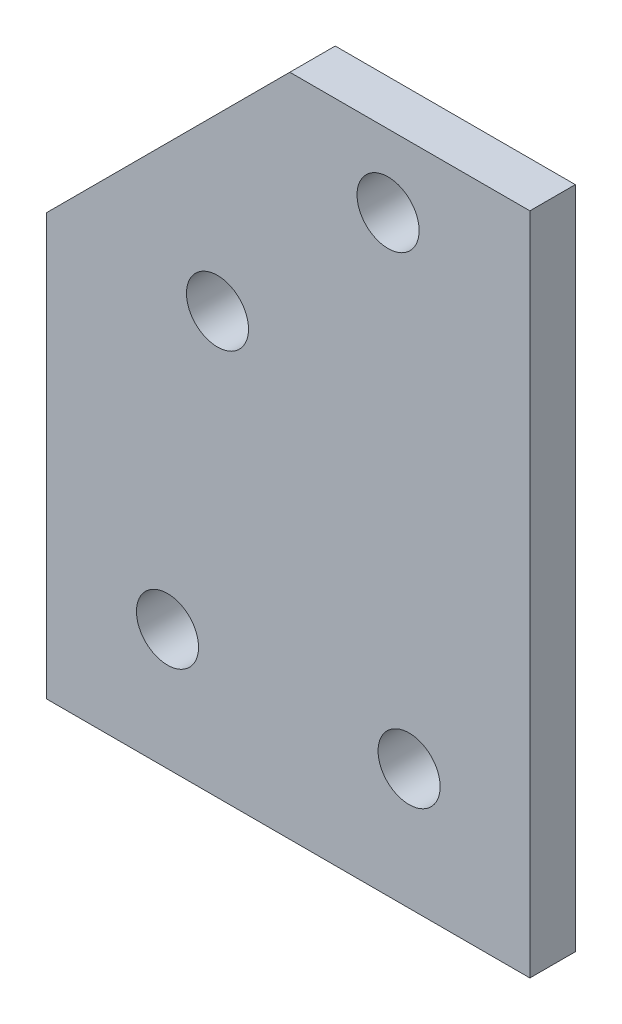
ISO-10303-21;
HEADER;
FILE_DESCRIPTION(('STEP AP214'),'2;1');
FILE_NAME('part.step','',(''),(''),'','','');
FILE_SCHEMA(('AUTOMOTIVE_DESIGN { 1 0 10303 214 1 1 1 1 }'));
ENDSEC;
DATA;
#1=APPLICATION_CONTEXT('core data for automotive mechanical design processes');
#2=APPLICATION_PROTOCOL_DEFINITION('international standard','automotive_design',2000,#1);
#3=PRODUCT_CONTEXT('',#1,'mechanical');
#4=PRODUCT('Part','Part','',(#3));
#5=PRODUCT_RELATED_PRODUCT_CATEGORY('part','',(#4));
#6=PRODUCT_DEFINITION_FORMATION('','',#4);
#7=PRODUCT_DEFINITION_CONTEXT('part definition',#1,'design');
#8=PRODUCT_DEFINITION('design','',#6,#7);
#9=PRODUCT_DEFINITION_SHAPE('','',#8);
#10=(LENGTH_UNIT() NAMED_UNIT(*) SI_UNIT(.MILLI.,.METRE.));
#11=(NAMED_UNIT(*) PLANE_ANGLE_UNIT() SI_UNIT($,.RADIAN.));
#12=(NAMED_UNIT(*) SI_UNIT($,.STERADIAN.) SOLID_ANGLE_UNIT());
#13=UNCERTAINTY_MEASURE_WITH_UNIT(LENGTH_MEASURE(1.E-05),#10,'distance_accuracy_value','');
#14=(GEOMETRIC_REPRESENTATION_CONTEXT(3) GLOBAL_UNCERTAINTY_ASSIGNED_CONTEXT((#13)) GLOBAL_UNIT_ASSIGNED_CONTEXT((#10,
#11,#12)) REPRESENTATION_CONTEXT('',''));
#15=CARTESIAN_POINT('',(0.,0.,0.));
#16=DIRECTION('',(0.,0.,1.));
#17=DIRECTION('',(1.,0.,0.));
#18=AXIS2_PLACEMENT_3D('',#15,#16,#17);
#19=CARTESIAN_POINT('',(0.,0.,4.7752));
#20=DIRECTION('',(0.,0.,1.));
#21=DIRECTION('',(1.,0.,0.));
#22=AXIS2_PLACEMENT_3D('',#19,#20,#21);
#23=PLANE('',#22);
#24=CARTESIAN_POINT('',(-7.44474,44.28998,4.7752));
#25=DIRECTION('',(0.,0.,1.));
#26=DIRECTION('',(1.,0.,0.));
#27=AXIS2_PLACEMENT_3D('',#24,#25,#26);
#28=CIRCLE('',#27,3.2639);
#29=CARTESIAN_POINT('',(-4.18084,44.28998,4.7752));
#30=VERTEX_POINT('',#29);
#31=EDGE_CURVE('E175',#30,#30,#28,.T.);
#32=ORIENTED_EDGE('',*,*,#31,.F.);
#33=EDGE_LOOP('',(#32));
#34=FACE_BOUND('',#33,.T.);
#35=CARTESIAN_POINT('',(12.7,12.7,4.7752));
#36=DIRECTION('',(0.,0.,1.));
#37=DIRECTION('',(1.,0.,0.));
#38=AXIS2_PLACEMENT_3D('',#35,#36,#37);
#39=CIRCLE('',#38,3.2639);
#40=CARTESIAN_POINT('',(15.9639,12.7,4.7752));
#41=VERTEX_POINT('',#40);
#42=EDGE_CURVE('E114',#41,#41,#39,.T.);
#43=ORIENTED_EDGE('',*,*,#42,.F.);
#44=EDGE_LOOP('',(#43));
#45=FACE_BOUND('',#44,.T.);
#46=DIRECTION('',(0.,-1.,0.));
#47=VECTOR('',#46,1.);
#48=CARTESIAN_POINT('',(-25.4,44.28998,4.7752));
#49=LINE('',#48,#47);
#50=CARTESIAN_POINT('',(-25.4,44.28998,4.7752));
#51=VERTEX_POINT('',#50);
#52=CARTESIAN_POINT('',(-25.4,0.,4.7752));
#53=VERTEX_POINT('',#52);
#54=EDGE_CURVE('E119',#51,#53,#49,.T.);
#55=ORIENTED_EDGE('',*,*,#54,.T.);
#56=DIRECTION('',(1.,0.,0.));
#57=VECTOR('',#56,1.);
#58=CARTESIAN_POINT('',(-25.4,0.,4.7752));
#59=LINE('',#58,#57);
#60=CARTESIAN_POINT('',(25.4,0.,4.7752));
#61=VERTEX_POINT('',#60);
#62=EDGE_CURVE('E86',#53,#61,#59,.T.);
#63=ORIENTED_EDGE('',*,*,#62,.T.);
#64=DIRECTION('',(0.,1.,0.));
#65=VECTOR('',#64,1.);
#66=CARTESIAN_POINT('',(25.4,0.,4.7752));
#67=LINE('',#66,#65);
#68=CARTESIAN_POINT('',(25.4,69.85,4.7752));
#69=VERTEX_POINT('',#68);
#70=EDGE_CURVE('E90',#61,#69,#67,.T.);
#71=ORIENTED_EDGE('',*,*,#70,.T.);
#72=DIRECTION('',(-1.,0.,0.));
#73=VECTOR('',#72,1.);
#74=CARTESIAN_POINT('',(25.4,69.85,4.7752));
#75=LINE('',#74,#73);
#76=CARTESIAN_POINT('',(0.16002,69.85,4.7752));
#77=VERTEX_POINT('',#76);
#78=EDGE_CURVE('E94',#69,#77,#75,.T.);
#79=ORIENTED_EDGE('',*,*,#78,.T.);
#80=DIRECTION('',(-0.707106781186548,-0.707106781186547,0.));
#81=VECTOR('',#80,1.);
#82=CARTESIAN_POINT('',(0.16002,69.85,4.7752));
#83=LINE('',#82,#81);
#84=EDGE_CURVE('E52',#77,#51,#83,.T.);
#85=ORIENTED_EDGE('',*,*,#84,.T.);
#86=EDGE_LOOP('',(#55,#63,#71,#79,#85));
#87=FACE_BOUND('',#86,.T.);
#88=CARTESIAN_POINT('',(10.4902,62.22492,4.7752));
#89=DIRECTION('',(0.,0.,1.));
#90=DIRECTION('',(1.,0.,0.));
#91=AXIS2_PLACEMENT_3D('',#88,#89,#90);
#92=CIRCLE('',#91,3.2639);
#93=CARTESIAN_POINT('',(13.7541,62.22492,4.7752));
#94=VERTEX_POINT('',#93);
#95=EDGE_CURVE('E181',#94,#94,#92,.T.);
#96=ORIENTED_EDGE('',*,*,#95,.F.);
#97=EDGE_LOOP('',(#96));
#98=FACE_BOUND('',#97,.T.);
#99=CARTESIAN_POINT('',(-12.7,12.7,4.7752));
#100=DIRECTION('',(0.,0.,1.));
#101=DIRECTION('',(1.,0.,0.));
#102=AXIS2_PLACEMENT_3D('',#99,#100,#101);
#103=CIRCLE('',#102,3.2639);
#104=CARTESIAN_POINT('',(-9.4361,12.7,4.7752));
#105=VERTEX_POINT('',#104);
#106=EDGE_CURVE('E166',#105,#105,#103,.T.);
#107=ORIENTED_EDGE('',*,*,#106,.F.);
#108=EDGE_LOOP('',(#107));
#109=FACE_BOUND('',#108,.T.);
#110=ADVANCED_FACE('F35',(#34,#45,#87,#98,#109),#23,.T.);
#111=CARTESIAN_POINT('',(0.,0.,0.));
#112=DIRECTION('',(0.,0.,1.));
#113=DIRECTION('',(1.,0.,0.));
#114=AXIS2_PLACEMENT_3D('',#111,#112,#113);
#115=PLANE('',#114);
#116=CARTESIAN_POINT('',(-7.44474,44.28998,0.));
#117=DIRECTION('',(0.,0.,1.));
#118=DIRECTION('',(1.,0.,0.));
#119=AXIS2_PLACEMENT_3D('',#116,#117,#118);
#120=CIRCLE('',#119,3.2639);
#121=CARTESIAN_POINT('',(-4.18084,44.28998,0.));
#122=VERTEX_POINT('',#121);
#123=EDGE_CURVE('E172',#122,#122,#120,.T.);
#124=ORIENTED_EDGE('',*,*,#123,.T.);
#125=EDGE_LOOP('',(#124));
#126=FACE_BOUND('',#125,.T.);
#127=CARTESIAN_POINT('',(12.7,12.7,0.));
#128=DIRECTION('',(0.,0.,1.));
#129=DIRECTION('',(1.,0.,0.));
#130=AXIS2_PLACEMENT_3D('',#127,#128,#129);
#131=CIRCLE('',#130,3.2639);
#132=CARTESIAN_POINT('',(15.9639,12.7,0.));
#133=VERTEX_POINT('',#132);
#134=EDGE_CURVE('E184',#133,#133,#131,.T.);
#135=ORIENTED_EDGE('',*,*,#134,.T.);
#136=EDGE_LOOP('',(#135));
#137=FACE_BOUND('',#136,.T.);
#138=DIRECTION('',(0.,-1.,0.));
#139=VECTOR('',#138,1.);
#140=CARTESIAN_POINT('',(-25.4,44.28998,0.));
#141=LINE('',#140,#139);
#142=CARTESIAN_POINT('',(-25.4,44.28998,0.));
#143=VERTEX_POINT('',#142);
#144=CARTESIAN_POINT('',(-25.4,0.,0.));
#145=VERTEX_POINT('',#144);
#146=EDGE_CURVE('E110',#143,#145,#141,.T.);
#147=ORIENTED_EDGE('',*,*,#146,.F.);
#148=DIRECTION('',(-0.707106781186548,-0.707106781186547,0.));
#149=VECTOR('',#148,1.);
#150=CARTESIAN_POINT('',(0.16002,69.85,0.));
#151=LINE('',#150,#149);
#152=CARTESIAN_POINT('',(0.16002,69.85,0.));
#153=VERTEX_POINT('',#152);
#154=EDGE_CURVE('E78',#153,#143,#151,.T.);
#155=ORIENTED_EDGE('',*,*,#154,.F.);
#156=DIRECTION('',(-1.,0.,0.));
#157=VECTOR('',#156,1.);
#158=CARTESIAN_POINT('',(25.4,69.85,0.));
#159=LINE('',#158,#157);
#160=CARTESIAN_POINT('',(25.4,69.85,0.));
#161=VERTEX_POINT('',#160);
#162=EDGE_CURVE('E72',#161,#153,#159,.T.);
#163=ORIENTED_EDGE('',*,*,#162,.F.);
#164=DIRECTION('',(0.,1.,0.));
#165=VECTOR('',#164,1.);
#166=CARTESIAN_POINT('',(25.4,0.,0.));
#167=LINE('',#166,#165);
#168=CARTESIAN_POINT('',(25.4,0.,0.));
#169=VERTEX_POINT('',#168);
#170=EDGE_CURVE('E101',#169,#161,#167,.T.);
#171=ORIENTED_EDGE('',*,*,#170,.F.);
#172=DIRECTION('',(1.,0.,0.));
#173=VECTOR('',#172,1.);
#174=CARTESIAN_POINT('',(-25.4,0.,0.));
#175=LINE('',#174,#173);
#176=EDGE_CURVE('E113',#145,#169,#175,.T.);
#177=ORIENTED_EDGE('',*,*,#176,.F.);
#178=EDGE_LOOP('',(#147,#155,#163,#171,#177));
#179=FACE_BOUND('',#178,.T.);
#180=CARTESIAN_POINT('',(10.4902,62.22492,0.));
#181=DIRECTION('',(0.,0.,1.));
#182=DIRECTION('',(1.,0.,0.));
#183=AXIS2_PLACEMENT_3D('',#180,#181,#182);
#184=CIRCLE('',#183,3.2639);
#185=CARTESIAN_POINT('',(13.7541,62.22492,0.));
#186=VERTEX_POINT('',#185);
#187=EDGE_CURVE('E178',#186,#186,#184,.T.);
#188=ORIENTED_EDGE('',*,*,#187,.T.);
#189=EDGE_LOOP('',(#188));
#190=FACE_BOUND('',#189,.T.);
#191=CARTESIAN_POINT('',(-12.7,12.7,0.));
#192=DIRECTION('',(0.,0.,1.));
#193=DIRECTION('',(1.,0.,0.));
#194=AXIS2_PLACEMENT_3D('',#191,#192,#193);
#195=CIRCLE('',#194,3.2639);
#196=CARTESIAN_POINT('',(-9.4361,12.7,0.));
#197=VERTEX_POINT('',#196);
#198=EDGE_CURVE('E169',#197,#197,#195,.T.);
#199=ORIENTED_EDGE('',*,*,#198,.T.);
#200=EDGE_LOOP('',(#199));
#201=FACE_BOUND('',#200,.T.);
#202=ADVANCED_FACE('F123',(#126,#137,#179,#190,#201),#115,.F.);
#203=CARTESIAN_POINT('',(-25.4,44.28998,4.7752));
#204=DIRECTION('',(1.,0.,0.));
#205=DIRECTION('',(0.,0.,-1.));
#206=AXIS2_PLACEMENT_3D('',#203,#204,#205);
#207=PLANE('',#206);
#208=ORIENTED_EDGE('',*,*,#146,.T.);
#209=DIRECTION('',(0.,0.,-1.));
#210=VECTOR('',#209,1.);
#211=CARTESIAN_POINT('',(-25.4,0.,4.7752));
#212=LINE('',#211,#210);
#213=EDGE_CURVE('E11',#53,#145,#212,.T.);
#214=ORIENTED_EDGE('',*,*,#213,.F.);
#215=ORIENTED_EDGE('',*,*,#54,.F.);
#216=DIRECTION('',(0.,0.,-1.));
#217=VECTOR('',#216,1.);
#218=CARTESIAN_POINT('',(-25.4,44.28998,4.7752));
#219=LINE('',#218,#217);
#220=EDGE_CURVE('E106',#51,#143,#219,.T.);
#221=ORIENTED_EDGE('',*,*,#220,.T.);
#222=EDGE_LOOP('',(#208,#214,#215,#221));
#223=FACE_BOUND('',#222,.T.);
#224=ADVANCED_FACE('F37',(#223),#207,.F.);
#225=CARTESIAN_POINT('',(-25.4,0.,4.7752));
#226=DIRECTION('',(0.,1.,0.));
#227=DIRECTION('',(0.,0.,1.));
#228=AXIS2_PLACEMENT_3D('',#225,#226,#227);
#229=PLANE('',#228);
#230=ORIENTED_EDGE('',*,*,#176,.T.);
#231=DIRECTION('',(0.,0.,-1.));
#232=VECTOR('',#231,1.);
#233=CARTESIAN_POINT('',(25.4,0.,4.7752));
#234=LINE('',#233,#232);
#235=EDGE_CURVE('E44',#61,#169,#234,.T.);
#236=ORIENTED_EDGE('',*,*,#235,.F.);
#237=ORIENTED_EDGE('',*,*,#62,.F.);
#238=ORIENTED_EDGE('',*,*,#213,.T.);
#239=EDGE_LOOP('',(#230,#236,#237,#238));
#240=FACE_BOUND('',#239,.T.);
#241=ADVANCED_FACE('F232',(#240),#229,.F.);
#242=CARTESIAN_POINT('',(25.4,0.,4.7752));
#243=DIRECTION('',(-1.,0.,0.));
#244=DIRECTION('',(0.,0.,1.));
#245=AXIS2_PLACEMENT_3D('',#242,#243,#244);
#246=PLANE('',#245);
#247=ORIENTED_EDGE('',*,*,#170,.T.);
#248=DIRECTION('',(0.,0.,-1.));
#249=VECTOR('',#248,1.);
#250=CARTESIAN_POINT('',(25.4,69.85,4.7752));
#251=LINE('',#250,#249);
#252=EDGE_CURVE('E98',#69,#161,#251,.T.);
#253=ORIENTED_EDGE('',*,*,#252,.F.);
#254=ORIENTED_EDGE('',*,*,#70,.F.);
#255=ORIENTED_EDGE('',*,*,#235,.T.);
#256=EDGE_LOOP('',(#247,#253,#254,#255));
#257=FACE_BOUND('',#256,.T.);
#258=ADVANCED_FACE('F99',(#257),#246,.F.);
#259=CARTESIAN_POINT('',(25.4,69.85,4.7752));
#260=DIRECTION('',(0.,-1.,0.));
#261=DIRECTION('',(0.,0.,-1.));
#262=AXIS2_PLACEMENT_3D('',#259,#260,#261);
#263=PLANE('',#262);
#264=ORIENTED_EDGE('',*,*,#162,.T.);
#265=DIRECTION('',(0.,0.,-1.));
#266=VECTOR('',#265,1.);
#267=CARTESIAN_POINT('',(0.16002,69.85,4.7752));
#268=LINE('',#267,#266);
#269=EDGE_CURVE('E102',#77,#153,#268,.T.);
#270=ORIENTED_EDGE('',*,*,#269,.F.);
#271=ORIENTED_EDGE('',*,*,#78,.F.);
#272=ORIENTED_EDGE('',*,*,#252,.T.);
#273=EDGE_LOOP('',(#264,#270,#271,#272));
#274=FACE_BOUND('',#273,.T.);
#275=ADVANCED_FACE('F104',(#274),#263,.F.);
#276=CARTESIAN_POINT('',(0.16002,69.85,4.7752));
#277=DIRECTION('',(0.707106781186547,-0.707106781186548,0.));
#278=DIRECTION('',(0.707106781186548,0.707106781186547,0.));
#279=AXIS2_PLACEMENT_3D('',#276,#277,#278);
#280=PLANE('',#279);
#281=ORIENTED_EDGE('',*,*,#154,.T.);
#282=ORIENTED_EDGE('',*,*,#220,.F.);
#283=ORIENTED_EDGE('',*,*,#84,.F.);
#284=ORIENTED_EDGE('',*,*,#269,.T.);
#285=EDGE_LOOP('',(#281,#282,#283,#284));
#286=FACE_BOUND('',#285,.T.);
#287=ADVANCED_FACE('F128',(#286),#280,.F.);
#288=CARTESIAN_POINT('',(12.7,12.7,4.7752));
#289=DIRECTION('',(0.,0.,-1.));
#290=DIRECTION('',(-1.,0.,0.));
#291=AXIS2_PLACEMENT_3D('',#288,#289,#290);
#292=CYLINDRICAL_SURFACE('',#291,3.2639);
#293=ORIENTED_EDGE('',*,*,#42,.T.);
#294=EDGE_LOOP('',(#293));
#295=FACE_BOUND('',#294,.T.);
#296=ORIENTED_EDGE('',*,*,#134,.F.);
#297=EDGE_LOOP('',(#296));
#298=FACE_BOUND('',#297,.T.);
#299=ADVANCED_FACE('F130',(#295,#298),#292,.F.);
#300=CARTESIAN_POINT('',(10.4902,62.22492,4.7752));
#301=DIRECTION('',(0.,0.,-1.));
#302=DIRECTION('',(-1.,0.,0.));
#303=AXIS2_PLACEMENT_3D('',#300,#301,#302);
#304=CYLINDRICAL_SURFACE('',#303,3.2639);
#305=ORIENTED_EDGE('',*,*,#95,.T.);
#306=EDGE_LOOP('',(#305));
#307=FACE_BOUND('',#306,.T.);
#308=ORIENTED_EDGE('',*,*,#187,.F.);
#309=EDGE_LOOP('',(#308));
#310=FACE_BOUND('',#309,.T.);
#311=ADVANCED_FACE('F136',(#307,#310),#304,.F.);
#312=CARTESIAN_POINT('',(-7.44474,44.28998,4.7752));
#313=DIRECTION('',(0.,0.,-1.));
#314=DIRECTION('',(-1.,0.,0.));
#315=AXIS2_PLACEMENT_3D('',#312,#313,#314);
#316=CYLINDRICAL_SURFACE('',#315,3.2639);
#317=ORIENTED_EDGE('',*,*,#31,.T.);
#318=EDGE_LOOP('',(#317));
#319=FACE_BOUND('',#318,.T.);
#320=ORIENTED_EDGE('',*,*,#123,.F.);
#321=EDGE_LOOP('',(#320));
#322=FACE_BOUND('',#321,.T.);
#323=ADVANCED_FACE('F153',(#319,#322),#316,.F.);
#324=CARTESIAN_POINT('',(-12.7,12.7,4.7752));
#325=DIRECTION('',(0.,0.,-1.));
#326=DIRECTION('',(-1.,0.,0.));
#327=AXIS2_PLACEMENT_3D('',#324,#325,#326);
#328=CYLINDRICAL_SURFACE('',#327,3.2639);
#329=ORIENTED_EDGE('',*,*,#106,.T.);
#330=EDGE_LOOP('',(#329));
#331=FACE_BOUND('',#330,.T.);
#332=ORIENTED_EDGE('',*,*,#198,.F.);
#333=EDGE_LOOP('',(#332));
#334=FACE_BOUND('',#333,.T.);
#335=ADVANCED_FACE('F157',(#331,#334),#328,.F.);
#336=CLOSED_SHELL('',(#110,#202,#224,#241,#258,#275,#287,#299,#311,#323,#335));
#337=MANIFOLD_SOLID_BREP('B2',#336);
#338=ADVANCED_BREP_SHAPE_REPRESENTATION('',(#18,#337),#14);
#339=SHAPE_DEFINITION_REPRESENTATION(#9,#338);
ENDSEC;
END-ISO-10303-21;
